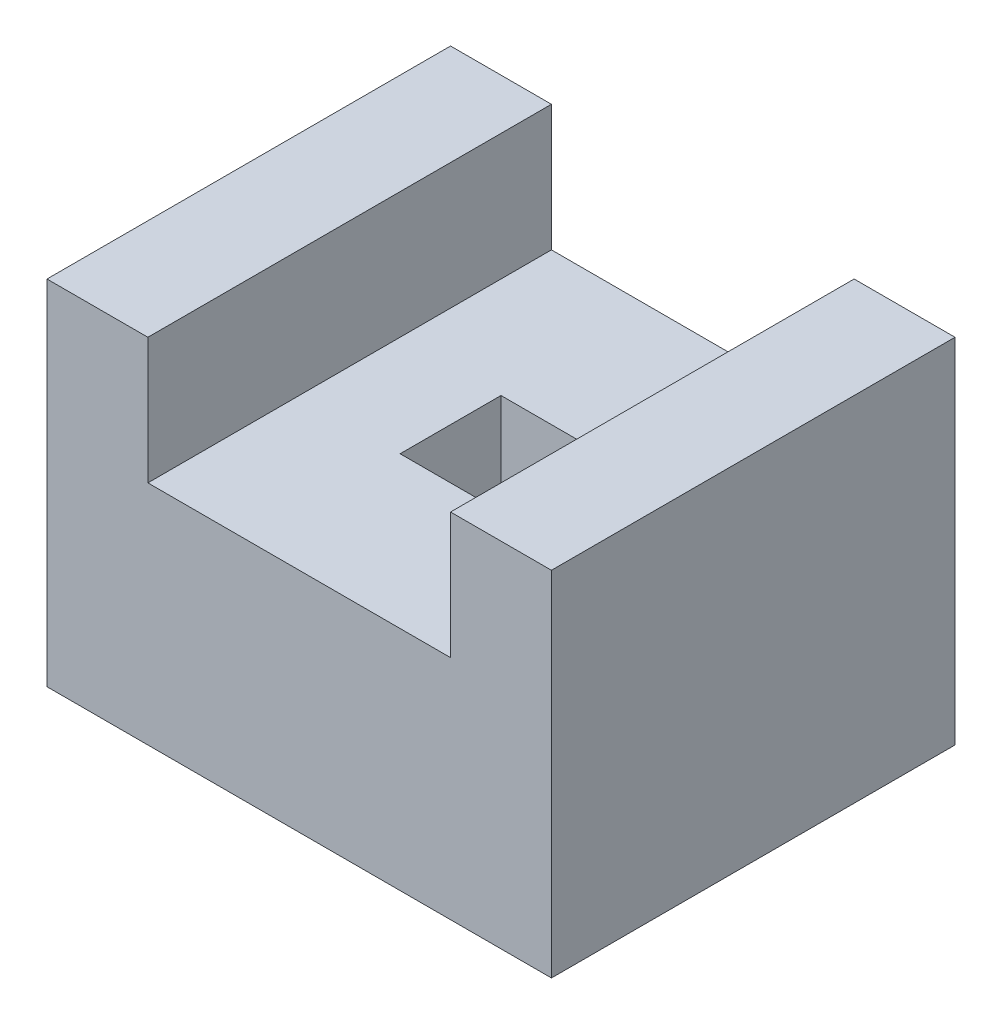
from build123d import *

# Parameters (mm, degrees)
EXTRUDE_1_DEPTH     = 80
SKETCH_2_W          = 20
SKETCH_2_H          = 20
CUT_EXTRUDE_1_DEPTH = 105.522724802


with BuildPart() as part:
    # Sketch 1 → Extrude 1 (new body)
    with BuildSketch(Plane.XY):
        Polygon((30, 35), (30, 10), (-30, 10), (-30, 35), (-50, 35), (-50, -35), (50, -35), (50, 35), align=None)
    extrude(amount=-EXTRUDE_1_DEPTH)

    # Sketch 2 → Cut-Extrude 1 (cut, through all)
    with BuildSketch(Plane(origin=(0, 10, 0), x_dir=(1, 0, 0), z_dir=(0, 1, 0))):
        with Locations((0, 40)):
            Rectangle(SKETCH_2_W, SKETCH_2_H)
    extrude(amount=-CUT_EXTRUDE_1_DEPTH, mode=Mode.SUBTRACT)


solid = part.part
